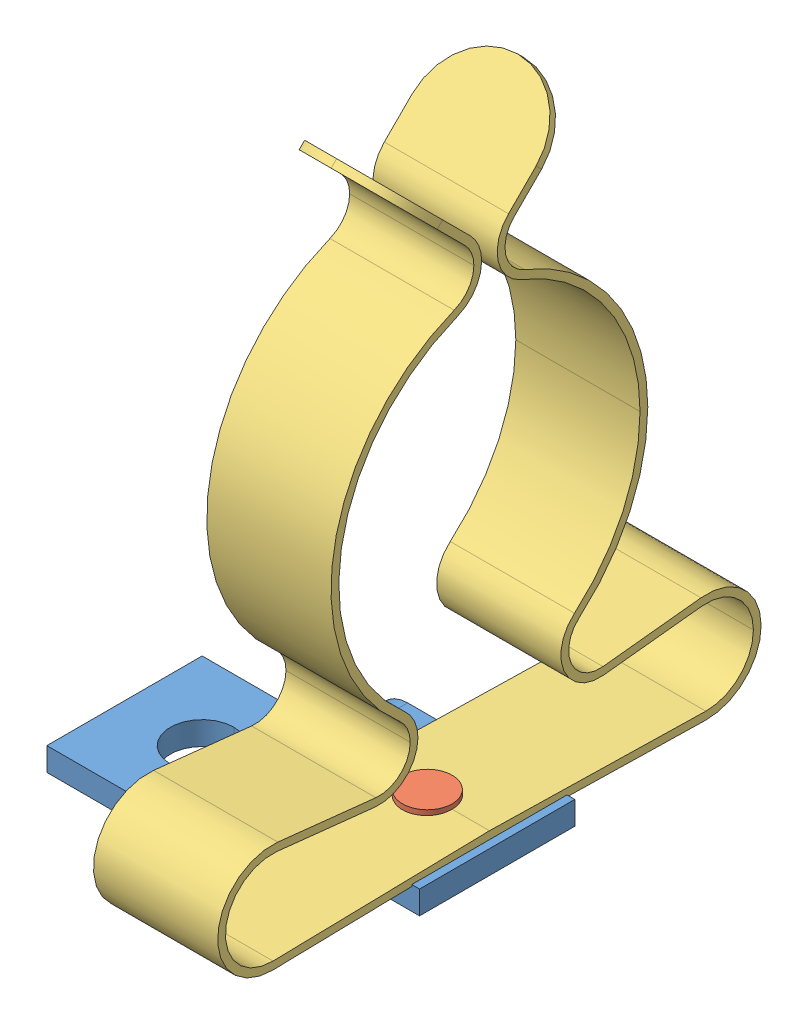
SolidWorks assembly 36259.SLDASM, configuration Default (file format 8000). Lengths in mm.
Overall size (24 44.4 35).
3 component instances, 3 part files, 0 mates.
Components (placement in the parent):
- 36259_01-1: 36259_01.SLDPRT [Default] at origin size (24 5.5 10)
- 36259_02-1: 36259_02.SLDPRT [Default] at origin size (6 3.3 6)
- 36259_03-1: 36259_03.SLDPRT [Default] at origin size (8 39.2 35)
